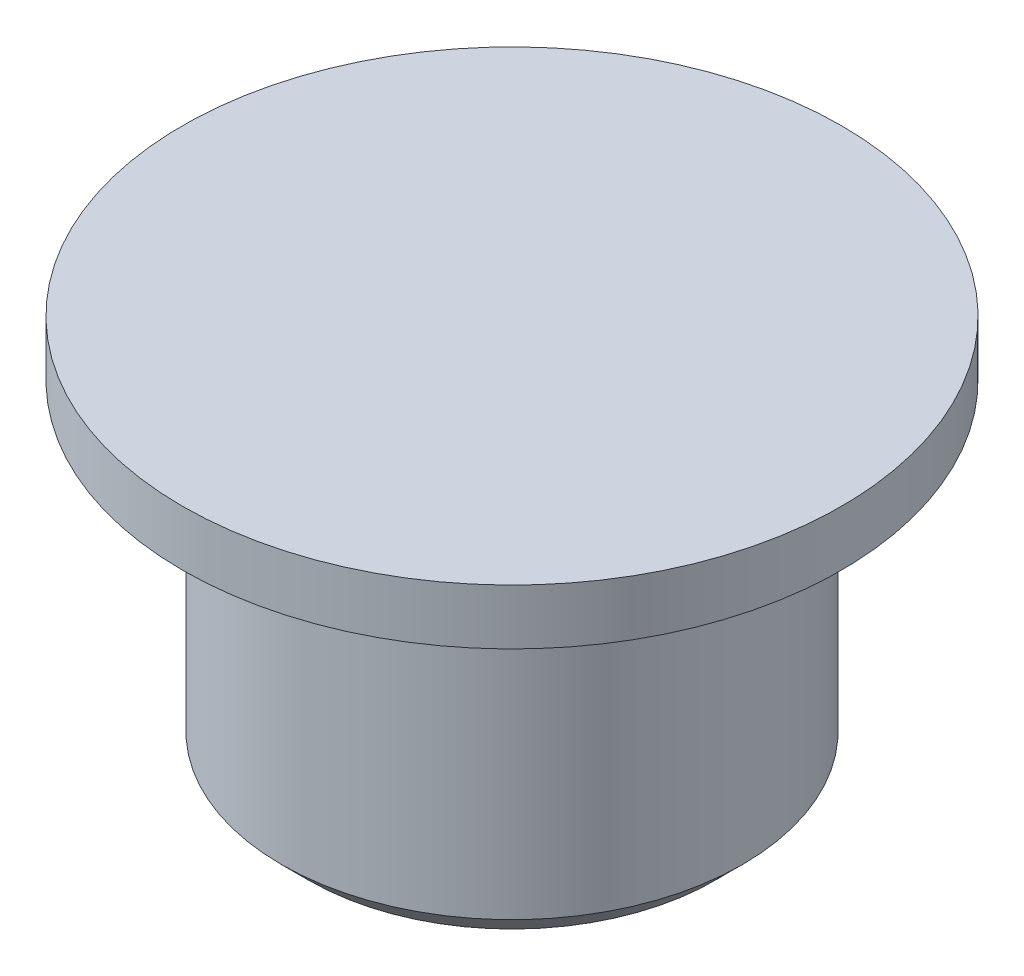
from build123d import *

# Parameters (mm, degrees)
ESQUISSE1_R      = 8.33
EXTRUSION1_DEPTH = 12
ESQUISSE2_R      = 11.906890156
EXTRUSION2_DEPTH = 2
CHANFREIN1_SIZE  = 1


with BuildPart() as part:
    # Esquisse1 → Extrusion1 (new body)
    with BuildSketch(Plane(origin=(0, 0, 0), x_dir=(1, 0, 0), z_dir=(0, 1, 0))):
        with Locations(Location((0, 0, 0), (0, 0, 270))):
            Circle(ESQUISSE1_R)
    extrude(amount=EXTRUSION1_DEPTH)

    # Esquisse2 → Extrusion2 (add)
    with BuildSketch(Plane(origin=(0, 12, 0), x_dir=(1, 0, 0), z_dir=(0, 1, 0))):
        with Locations(Location((0, 0, 0), (0, 0, 270))):
            Circle(ESQUISSE2_R)
    extrude(amount=EXTRUSION2_DEPTH)

    # Chanfrein1
    chanfrein1_edges = [part.edges().sort_by_distance(p)[0] for p in [
        (0, 0, -8.33),
    ]]
    chamfer(chanfrein1_edges, length=CHANFREIN1_SIZE)


solid = part.part
